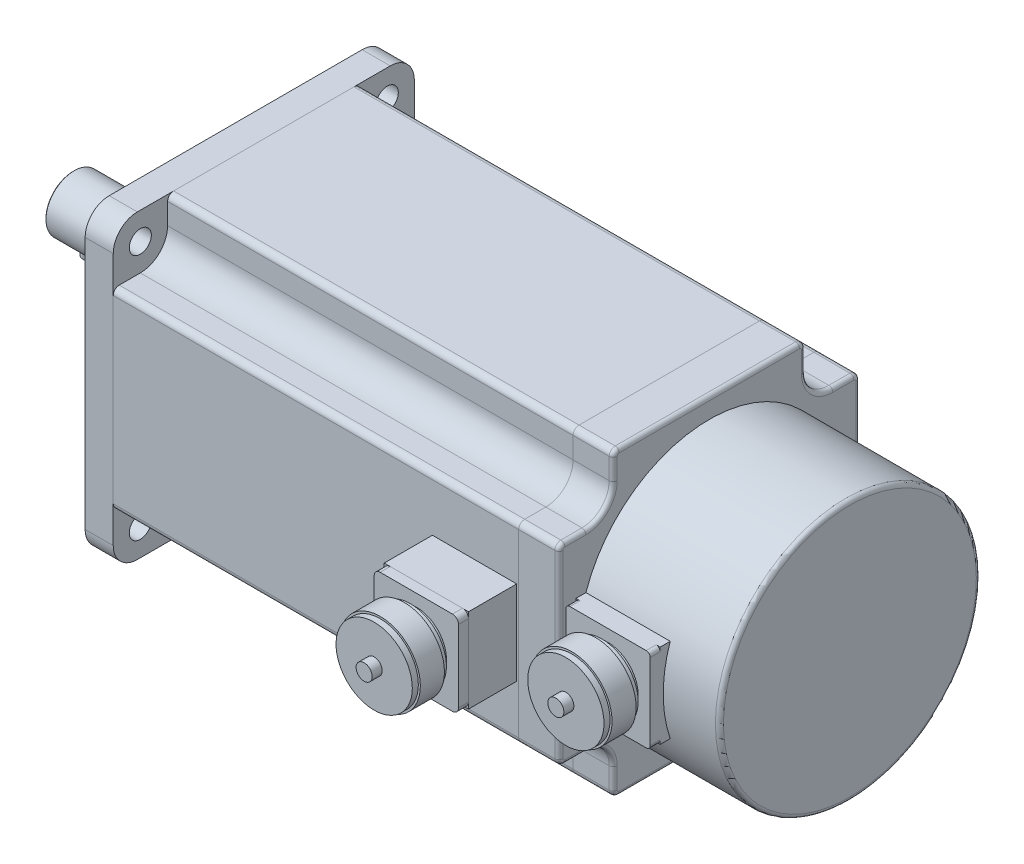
from build123d import *

# Parameters (mm, degrees)
EXTRUDE_1_DEPTH     = 20
EXTRUDE_2_DEPTH     = 202
EXTRUDE_3_DEPTH     = 14
SKETCH_4_W          = 42
SKETCH_4_H          = 42
EXTRUDE_4_DEPTH     = 24
EXTRUDE_5_DEPTH     = 5
SKETCH_6_R          = 15
EXTRUDE_6_DEPTH     = 3
SKETCH_7_R          = 18
EXTRUDE_7_DEPTH     = 3
SKETCH_8_R          = 20
EXTRUDE_8_DEPTH     = 12
SKETCH_9_R          = 19
EXTRUDE_9_DEPTH     = 3
SKETCH_10_R         = 4
EXTRUDE_10_DEPTH    = 5
CUT_EXTRUDE_START   = -222
CUT_EXTRUDE_2_DEPTH = 222
FILLET_1_R          = 2
SKETCH_12_R         = 5.5
CUT_EXTRUDE_3_DEPTH = 14
SKETCH_13_R         = 65
SKETCH_13_R_2       = 57.5
EXTRUDE_11_DEPTH    = 6
SKETCH_14_R         = 35
EXTRUDE_12_DEPTH    = 6
SKETCH_15_R         = 17.5
EXTRUDE_13_DEPTH    = 3
FILLET_2_R          = 0.5
SKETCH_16_R         = 14
EXTRUDE_14_DEPTH    = 72
CHAMFER_1_SIZE      = 0.5
SKETCH_19_R         = 65
EXTRUDE_16_DEPTH    = 70
FILLET_3_R          = 2
SKETCH_20_W         = 42
SKETCH_20_H         = 42
CUT_EXTRUDE_5_DEPTH = 10
SKETCH_21_W         = 42
SKETCH_21_H         = 42
EXTRUDE_17_DEPTH    = 11.5
EXTRUDE_18_DEPTH    = 5
SKETCH_23_R         = 15
EXTRUDE_19_DEPTH    = 3
SKETCH_24_R         = 18
EXTRUDE_20_DEPTH    = 3
SKETCH_25_R         = 20
EXTRUDE_21_DEPTH    = 12
SKETCH_26_R         = 19
EXTRUDE_22_DEPTH    = 3
SKETCH_27_R         = 4
EXTRUDE_23_DEPTH    = 5
CUT_EXTRUDE_6_DEPTH = 4
EXTRUDE_24_DEPTH    = 8


with BuildPart() as part:
    # Sketch 1 → Extrude 1 (new body)
    with BuildSketch(Plane(origin=(0, 0, 0), x_dir=(0, 0, -1), z_dir=(1, 0, 0))):
        with BuildLine():
            Line((-63, -75), (63, -75))
            ThreePointArc((63, -75), (71.485281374, -71.485281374), (75, -63))
            Line((75, -63), (75, 63))
            ThreePointArc((75, 63), (71.485281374, 71.485281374), (63, 75))
            Line((63, 75), (-63, 75))
            ThreePointArc((-63, 75), (-71.485281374, 71.485281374), (-75, 63))
            Line((-75, 63), (-75, -63))
            ThreePointArc((-75, -63), (-71.485281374, -71.485281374), (-63, -75))
        make_face()
    extrude(amount=EXTRUDE_1_DEPTH)


with BuildPart() as body_2:
    # Sketch 2 → Extrude 2 (new body)
    with BuildSketch(Plane.ZY):
        with BuildLine():
            Line((-63, -75), (63, -75))
            ThreePointArc((63, -75), (71.485281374, -71.485281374), (75, -63))
            Line((75, -63), (75, 63))
            ThreePointArc((75, 63), (71.485281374, 71.485281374), (63, 75))
            Line((63, 75), (-63, 75))
            ThreePointArc((-63, 75), (-71.485281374, 71.485281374), (-75, 63))
            Line((-75, 63), (-75, -63))
            ThreePointArc((-75, -63), (-71.485281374, -71.485281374), (-63, -75))
        make_face()
    extrude(amount=EXTRUDE_2_DEPTH)


with BuildPart() as body_3:
    # Sketch 3 → Extrude 3 (new body)
    with BuildSketch(Plane.ZY.offset(202)):
        with BuildLine():
            Line((-63, -75), (63, -75))
            ThreePointArc((63, -75), (71.485281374, -71.485281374), (75, -63))
            Line((75, -63), (75, 63))
            ThreePointArc((75, 63), (71.485281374, 71.485281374), (63, 75))
            Line((63, 75), (-63, 75))
            ThreePointArc((-63, 75), (-71.485281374, 71.485281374), (-75, 63))
            Line((-75, 63), (-75, -63))
            ThreePointArc((-75, -63), (-71.485281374, -71.485281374), (-63, -75))
        make_face()
    extrude(amount=EXTRUDE_3_DEPTH)

    # Sketch 12 → Cut-Extrude 3 (cut)
    with BuildSketch(Plane.ZY.offset(216)):
        with Locations((-61.518289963, 61.518289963)):
            Circle(SKETCH_12_R)
        with Locations((61.518289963, 61.518289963)):
            Circle(SKETCH_12_R)
        with Locations((-61.518289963, -61.518289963)):
            Circle(SKETCH_12_R)
        with Locations((61.518289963, -61.518289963)):
            Circle(SKETCH_12_R)
    extrude(amount=-CUT_EXTRUDE_3_DEPTH, mode=Mode.SUBTRACT)



with BuildPart() as body_4:
    # Sketch 4 → Extrude 4 (new body)
    with BuildSketch(Plane.XY.offset(75)):
        with Locations((-22, 0)):
            Rectangle(SKETCH_4_W, SKETCH_4_H)
    extrude(amount=EXTRUDE_4_DEPTH)


with BuildPart() as body_5:
    # Sketch 5 → Extrude 5 (new body)
    with BuildSketch(Plane.XY.offset(99)):
        with BuildLine():
            Line((-40, -21), (-4, -21))
            ThreePointArc((-4, -21), (-1.878679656, -20.121320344), (-1, -18))
            Line((-1, -18), (-1, 18))
            ThreePointArc((-1, 18), (-1.878679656, 20.121320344), (-4, 21))
            Line((-4, 21), (-40, 21))
            ThreePointArc((-40, 21), (-42.121320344, 20.121320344), (-43, 18))
            Line((-43, 18), (-43, -18))
            ThreePointArc((-43, -18), (-42.121320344, -20.121320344), (-40, -21))
        make_face()
    extrude(amount=EXTRUDE_5_DEPTH)


with BuildPart() as body_6:
    # Sketch 6 → Extrude 6 (new body)
    with BuildSketch(Plane.XY.offset(104)):
        with Locations((-22, 0)):
            Circle(SKETCH_6_R)
    extrude(amount=EXTRUDE_6_DEPTH)


with BuildPart() as body_7:
    # Sketch 7 → Extrude 7 (new body)
    with BuildSketch(Plane.XY.offset(107)):
        with Locations((-22, 0)):
            Circle(SKETCH_7_R)
    extrude(amount=EXTRUDE_7_DEPTH)


with BuildPart() as body_8:
    # Sketch 8 → Extrude 8 (new body)
    with BuildSketch(Plane.XY.offset(110)):
        with Locations((-22, 0)):
            Circle(SKETCH_8_R)
    extrude(amount=EXTRUDE_8_DEPTH)

    # Sketch 9 → Extrude 9 (add)
    with BuildSketch(Plane.XY.offset(122)):
        with Locations((-22, 0)):
            Circle(SKETCH_9_R)
    extrude(amount=EXTRUDE_9_DEPTH)

    # Sketch 10 → Extrude 10 (add)
    with BuildSketch(Plane.XY.offset(125)):
        with Locations((-22, 0)):
            Circle(SKETCH_10_R)
    extrude(amount=EXTRUDE_10_DEPTH)


with BuildPart() as cut_extrude_2_tool:
    # Sketch 11 → Cut-Extrude 2 (new body)
    with BuildSketch(Plane(origin=(20, 0, 0), x_dir=(0, 0, -1), z_dir=(1, 0, 0)).offset(CUT_EXTRUDE_START)):
        with BuildLine():
            Line((47.916922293, -61.5), (47.916922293, -72))
            ThreePointArc((47.916922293, -72), (47.038242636, -74.121320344), (44.916922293, -75))
            Line((44.916922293, -75), (63, -75))
            ThreePointArc((63, -75), (71.485281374, -71.485281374), (75, -63))
            Line((75, -63), (75, -44.916922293))
            ThreePointArc((75, -44.916922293), (74.121320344, -47.038242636), (72, -47.916922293))
            Line((72, -47.916922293), (61.5, -47.916922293))
            ThreePointArc((61.5, -47.916922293), (51.895313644, -51.895313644), (47.916922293, -61.5))
        make_face()
        with BuildLine():
            Line((-75, -44.916922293), (-75, -63))
            ThreePointArc((-75, -63), (-71.485281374, -71.485281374), (-63, -75))
            Line((-63, -75), (-44.916922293, -75))
            ThreePointArc((-44.916922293, -75), (-47.038242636, -74.121320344), (-47.916922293, -72))
            Line((-47.916922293, -72), (-47.916922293, -61.5))
            ThreePointArc((-47.916922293, -61.5), (-51.895313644, -51.895313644), (-61.5, -47.916922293))
            Line((-61.5, -47.916922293), (-72, -47.916922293))
            ThreePointArc((-72, -47.916922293), (-74.121320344, -47.038242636), (-75, -44.916922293))
        make_face()
        with BuildLine():
            Line((75, 63), (75, 44.916922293))
            ThreePointArc((75, 44.916922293), (74.121320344, 47.038242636), (72, 47.916922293))
            Line((72, 47.916922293), (61.5, 47.916922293))
            ThreePointArc((61.5, 47.916922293), (51.895313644, 51.895313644), (47.916922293, 61.5))
            Line((47.916922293, 61.5), (47.916922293, 72))
            ThreePointArc((47.916922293, 72), (47.038242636, 74.121320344), (44.916922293, 75))
            Line((44.916922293, 75), (63, 75))
            ThreePointArc((63, 75), (71.485281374, 71.485281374), (75, 63))
        make_face()
        with BuildLine():
            Line((-44.916922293, 75), (-63, 75))
            ThreePointArc((-63, 75), (-71.485281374, 71.485281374), (-75, 63))
            Line((-75, 63), (-75, 44.916922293))
            ThreePointArc((-75, 44.916922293), (-74.121320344, 47.038242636), (-72, 47.916922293))
            Line((-72, 47.916922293), (-61.5, 47.916922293))
            ThreePointArc((-61.5, 47.916922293), (-51.895313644, 51.895313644), (-47.916922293, 61.5))
            Line((-47.916922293, 61.5), (-47.916922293, 72))
            ThreePointArc((-47.916922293, 72), (-47.038242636, 74.121320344), (-44.916922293, 75))
        make_face()
    extrude(amount=CUT_EXTRUDE_2_DEPTH)


with BuildPart() as part_1:
    add(part.part)

    # Cut-Extrude 2: cut by cut_extrude_2_tool
    add(cut_extrude_2_tool.part, mode=Mode.SUBTRACT)

    # Fillet 1
    fillet_1_edges = [part_1.edges().sort_by_distance(p)[0] for p in [
        (20, 51.895313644, -51.895313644),
        (20, 47.916922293, -66.75),
        (20, 47.038242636, -74.121320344),
        (20, 74.121320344, -47.038242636),
        (20, 66.75, -47.916922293),
        (20, 0, -75),
        (20, 75, 0),
        (20, 0, 75),
        (20, -75, 0),
        (20, -47.038242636, 74.121320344),
        (20, -74.121320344, 47.038242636),
        (20, -66.75, 47.916922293),
        (20, -51.895313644, 51.895313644),
        (20, -47.916922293, 66.75),
        (20, -51.895313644, -51.895313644),
        (20, -66.75, -47.916922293),
        (20, -74.121320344, -47.038242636),
        (20, -47.038242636, -74.121320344),
        (20, -47.916922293, -66.75),
        (20, 47.038242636, 74.121320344),
        (20, 47.916922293, 66.75),
        (20, 51.895313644, 51.895313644),
        (20, 66.75, 47.916922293),
        (20, 74.121320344, 47.038242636),
    ]]
    fillet(fillet_1_edges, radius=FILLET_1_R)



with BuildPart() as body_2_1:
    add(body_2.part)

    # Cut-Extrude 2: cut by cut_extrude_2_tool
    add(cut_extrude_2_tool.part, mode=Mode.SUBTRACT)


with BuildPart() as body_9:
    # Sketch 13 → Extrude 11 (new body)
    with BuildSketch(Plane.ZY.offset(216)):
        Circle(SKETCH_13_R)
        Circle(SKETCH_13_R_2, mode=Mode.SUBTRACT)
    extrude(amount=EXTRUDE_11_DEPTH)


with BuildPart() as body_3_1:
    add(body_3.part)

    add(body_9.part)  # Extrude 12 merges body 9
    # Sketch 14 → Extrude 12 (add)
    with BuildSketch(Plane.ZY.offset(216)):
        with Locations(Location((0, 0, 0), (0, 0, 180))):
            Circle(SKETCH_14_R)
    extrude(amount=EXTRUDE_12_DEPTH)


with BuildPart() as body_9_2:
    # Sketch 15 → Extrude 13 (new body)
    with BuildSketch(Plane.ZY.offset(222)):
        Circle(SKETCH_15_R)
    extrude(amount=EXTRUDE_13_DEPTH)

    # Fillet 2
    fillet_2_edges = [body_9_2.edges().sort_by_distance(p)[0] for p in [
        (-225, 0, -17.5),
    ]]
    fillet(fillet_2_edges, radius=FILLET_2_R)

    # Sketch 16 → Extrude 14 (add)
    with BuildSketch(Plane.ZY.offset(225)):
        Circle(SKETCH_16_R)
    extrude(amount=EXTRUDE_14_DEPTH)

    # Chamfer 1
    chamfer_1_edges = [body_9_2.edges().sort_by_distance(p)[0] for p in [
        (-297, 0, -14),
    ]]
    chamfer(chamfer_1_edges, length=CHAMFER_1_SIZE)

    # Sketch 29 → Cut-Extrude 6 (cut)
    with BuildSketch(Plane(origin=(0, -14, 0), x_dir=(1, 0, 0), z_dir=(0, 1, 0))):
        with BuildLine():
            Line((-288, -4), (-241, -4))
            ThreePointArc((-241, -4), (-237, 0), (-241, 4))
            Line((-241, 4), (-288, 4))
            ThreePointArc((-288, 4), (-292, 0), (-288, -4))
        make_face()
    extrude(amount=CUT_EXTRUDE_6_DEPTH, mode=Mode.SUBTRACT)


with BuildPart() as body_10:
    # Sketch 19 → Extrude 16 (new body)
    with BuildSketch(Plane(origin=(20, 0, 0), x_dir=(0, 0, -1), z_dir=(1, 0, 0))):
        Circle(SKETCH_19_R)
    extrude(amount=EXTRUDE_16_DEPTH)

    # Fillet 3
    fillet_3_edges = [body_10.edges().sort_by_distance(p)[0] for p in [
        (90, 0, 65),
    ]]
    fillet(fillet_3_edges, radius=FILLET_3_R)

    # Sketch 20 → Cut-Extrude 5 (cut)
    with BuildSketch(Plane.XY.offset(65)):
        with Locations((41, 0)):
            Rectangle(SKETCH_20_W, SKETCH_20_H)
    extrude(amount=-CUT_EXTRUDE_5_DEPTH, mode=Mode.SUBTRACT)


with BuildPart() as part_2:
    add(part_1.part)

    add(body_10.part)  # Extrude 17 merges body 10
    # Sketch 21 → Extrude 17 (add)
    with BuildSketch(Plane.XY.offset(55)):
        with Locations((41, 0)):
            Rectangle(SKETCH_21_W, SKETCH_21_H)
    extrude(amount=EXTRUDE_17_DEPTH)



with BuildPart() as body_10_2:
    # Sketch 22 → Extrude 18 (new body)
    with BuildSketch(Plane.XY.offset(66.5)):
        with BuildLine():
            Line((22, -21), (60, -21))
            ThreePointArc((60, -21), (61.414213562, -20.414213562), (62, -19))
            Line((62, -19), (62, 19))
            ThreePointArc((62, 19), (61.414213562, 20.414213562), (60, 21))
            Line((60, 21), (22, 21))
            ThreePointArc((22, 21), (20.585786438, 20.414213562), (20, 19))
            Line((20, 19), (20, -19))
            ThreePointArc((20, -19), (20.585786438, -20.414213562), (22, -21))
        make_face()
    extrude(amount=EXTRUDE_18_DEPTH)


with BuildPart() as part_3:
    add(part_2.part)

    add(body_10_2.part)  # Extrude 19 merges body 10 2
    # Sketch 23 → Extrude 19 (add)
    with BuildSketch(Plane.XY.offset(71.5)):
        with Locations(Location((41, 0, 0), (0, 0, 180))):
            Circle(SKETCH_23_R)
    extrude(amount=EXTRUDE_19_DEPTH)

    # Sketch 24 → Extrude 20 (add)
    with BuildSketch(Plane.XY.offset(74.5)):
        with Locations((41, 0)):
            Circle(SKETCH_24_R)
    extrude(amount=EXTRUDE_20_DEPTH)

    # Sketch 25 → Extrude 21 (add)
    with BuildSketch(Plane.XY.offset(77.5)):
        with Locations((41, 0)):
            Circle(SKETCH_25_R)
    extrude(amount=EXTRUDE_21_DEPTH)

    # Sketch 26 → Extrude 22 (add)
    with BuildSketch(Plane.XY.offset(89.5)):
        with Locations((41, 0)):
            Circle(SKETCH_26_R)
    extrude(amount=EXTRUDE_22_DEPTH)

    # Sketch 27 → Extrude 23 (add)
    with BuildSketch(Plane.XY.offset(92.5)):
        with Locations((41, 0)):
            Circle(SKETCH_27_R)
    extrude(amount=EXTRUDE_23_DEPTH)


with BuildPart() as body_10_3:
    # Sketch 30 → Extrude 24 (new body)
    with BuildSketch(Plane.XZ.offset(10)):
        with BuildLine():
            Line((-288, 4), (-241, 4))
            ThreePointArc((-241, 4), (-237, 0), (-241, -4))
            Line((-241, -4), (-288, -4))
            ThreePointArc((-288, -4), (-292, 0), (-288, 4))
        make_face()
    extrude(amount=EXTRUDE_24_DEPTH)


solid = Compound([body_4.part, body_5.part, body_6.part, body_7.part, body_8.part, body_2_1.part, body_3_1.part, body_9_2.part, part_3.part, body_10_3.part])
